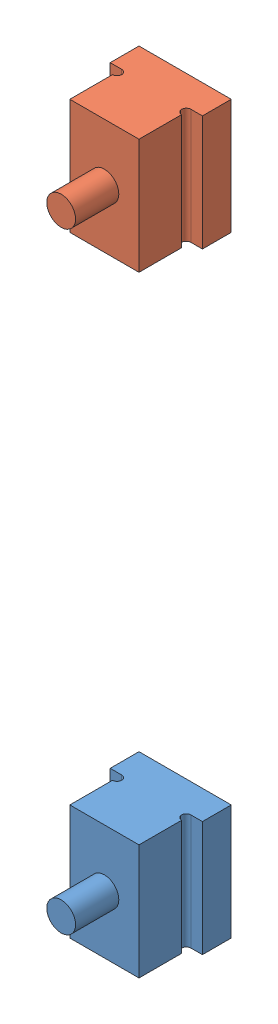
SolidWorks assembly img125_160-16k.SLDASM, configuration Default (file format 16000). Lengths in mm.
Overall size (16 126 21.5).
2 component instances, 2 part files, 0 mates.
Components (placement in the parent):
- img125_160-16k_01-1: img125_160-16k_01.SLDPRT [Default] at origin size (16 20 21.5)
- img125_160-16k_02-1: img125_160-16k_02.SLDPRT [Default] at (0 106 0) size (16 20 21.5)
